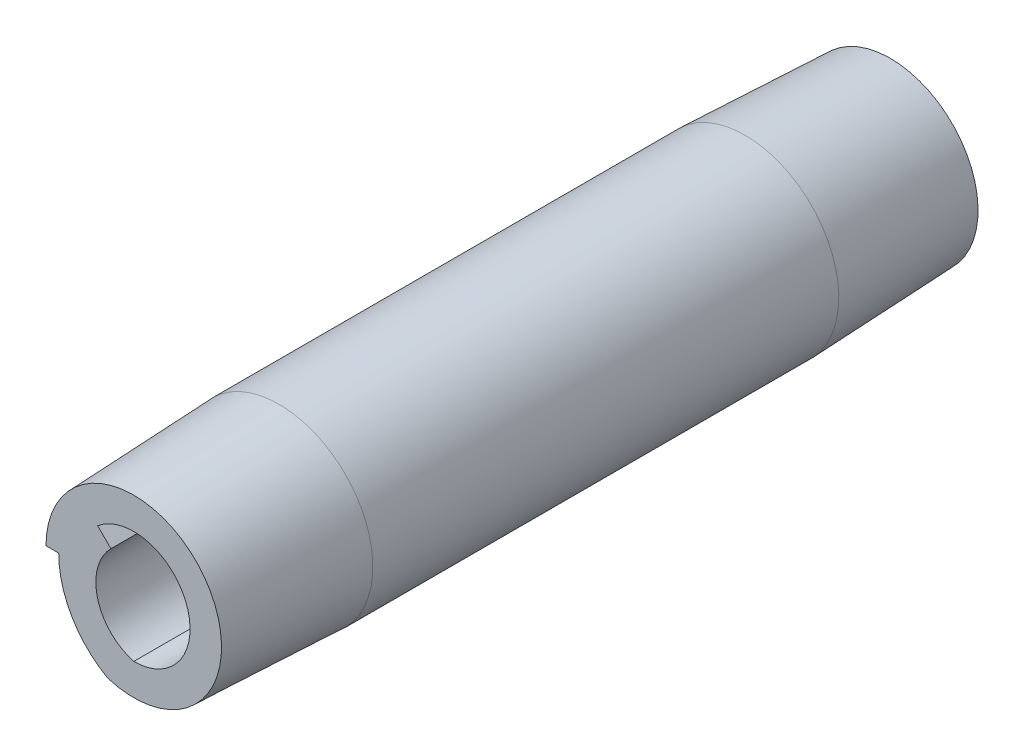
ISO-10303-21;
HEADER;
FILE_DESCRIPTION(('STEP AP214'),'2;1');
FILE_NAME('part.step','',(''),(''),'','','');
FILE_SCHEMA(('AUTOMOTIVE_DESIGN { 1 0 10303 214 1 1 1 1 }'));
ENDSEC;
DATA;
#1=APPLICATION_CONTEXT('core data for automotive mechanical design processes');
#2=APPLICATION_PROTOCOL_DEFINITION('international standard','automotive_design',2000,#1);
#3=PRODUCT_CONTEXT('',#1,'mechanical');
#4=PRODUCT('Part','Part','',(#3));
#5=PRODUCT_RELATED_PRODUCT_CATEGORY('part','',(#4));
#6=PRODUCT_DEFINITION_FORMATION('','',#4);
#7=PRODUCT_DEFINITION_CONTEXT('part definition',#1,'design');
#8=PRODUCT_DEFINITION('design','',#6,#7);
#9=PRODUCT_DEFINITION_SHAPE('','',#8);
#10=(LENGTH_UNIT() NAMED_UNIT(*) SI_UNIT(.MILLI.,.METRE.));
#11=(NAMED_UNIT(*) PLANE_ANGLE_UNIT() SI_UNIT($,.RADIAN.));
#12=(NAMED_UNIT(*) SI_UNIT($,.STERADIAN.) SOLID_ANGLE_UNIT());
#13=UNCERTAINTY_MEASURE_WITH_UNIT(LENGTH_MEASURE(1.E-05),#10,'distance_accuracy_value','');
#14=(GEOMETRIC_REPRESENTATION_CONTEXT(3) GLOBAL_UNCERTAINTY_ASSIGNED_CONTEXT((#13)) GLOBAL_UNIT_ASSIGNED_CONTEXT((#10,
#11,#12)) REPRESENTATION_CONTEXT('',''));
#15=CARTESIAN_POINT('',(0.,0.,0.));
#16=DIRECTION('',(0.,0.,1.));
#17=DIRECTION('',(1.,0.,0.));
#18=AXIS2_PLACEMENT_3D('',#15,#16,#17);
#19=CARTESIAN_POINT('',(0.,0.,1.5875));
#20=DIRECTION('',(0.,0.,-1.));
#21=DIRECTION('',(-1.,0.,0.));
#22=AXIS2_PLACEMENT_3D('',#19,#20,#21);
#23=PLANE('',#22);
#24=CARTESIAN_POINT('',(0.,0.,1.5875));
#25=DIRECTION('',(0.,0.,1.));
#26=DIRECTION('',(-1.,0.,0.));
#27=AXIS2_PLACEMENT_3D('',#24,#25,#26);
#28=CIRCLE('',#27,0.23622);
#29=CARTESIAN_POINT('',(0.,-0.23622,1.5875));
#30=VERTEX_POINT('',#29);
#31=CARTESIAN_POINT('',(-0.151522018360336,0.181220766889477,1.5875));
#32=VERTEX_POINT('',#31);
#33=EDGE_CURVE('E188',#30,#32,#28,.T.);
#34=ORIENTED_EDGE('',*,*,#33,.F.);
#35=CARTESIAN_POINT('',(0.0571892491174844,-0.0274905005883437,1.5875));
#36=DIRECTION('',(0.,0.,1.));
#37=DIRECTION('',(-1.,0.,0.));
#38=AXIS2_PLACEMENT_3D('',#35,#36,#37);
#39=CIRCLE('',#38,0.216422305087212);
#40=CARTESIAN_POINT('',(-0.0958444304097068,0.125543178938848,1.5875));
#41=VERTEX_POINT('',#40);
#42=EDGE_CURVE('E197',#41,#30,#39,.T.);
#43=ORIENTED_EDGE('',*,*,#42,.F.);
#44=DIRECTION('',(0.707106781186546,-0.707106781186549,0.));
#45=VECTOR('',#44,1.);
#46=CARTESIAN_POINT('',(-0.151522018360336,0.181220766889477,1.5875));
#47=LINE('',#46,#45);
#48=EDGE_CURVE('E190',#32,#41,#47,.T.);
#49=ORIENTED_EDGE('',*,*,#48,.F.);
#50=EDGE_LOOP('',(#34,#43,#49));
#51=FACE_BOUND('',#50,.T.);
#52=CARTESIAN_POINT('',(0.0885825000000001,0.,1.5875));
#53=DIRECTION('',(0.,0.,1.));
#54=DIRECTION('',(-1.,0.,0.));
#55=AXIS2_PLACEMENT_3D('',#52,#53,#54);
#56=CIRCLE('',#55,0.4035425);
#57=CARTESIAN_POINT('',(-0.31496,0.,1.5875));
#58=VERTEX_POINT('',#57);
#59=CARTESIAN_POINT('',(-0.109247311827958,-0.351724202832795,1.5875));
#60=VERTEX_POINT('',#59);
#61=EDGE_CURVE('E138',#58,#60,#56,.T.);
#62=ORIENTED_EDGE('',*,*,#61,.T.);
#63=CARTESIAN_POINT('',(0.,0.,1.5875));
#64=DIRECTION('',(0.,0.,-1.));
#65=DIRECTION('',(-1.,0.,0.));
#66=AXIS2_PLACEMENT_3D('',#63,#64,#65);
#67=CIRCLE('',#66,0.3683);
#68=CARTESIAN_POINT('',(-0.3683,0.,1.5875));
#69=VERTEX_POINT('',#68);
#70=EDGE_CURVE('E60',#69,#60,#67,.T.);
#71=ORIENTED_EDGE('',*,*,#70,.F.);
#72=DIRECTION('',(1.,0.,0.));
#73=VECTOR('',#72,1.);
#74=CARTESIAN_POINT('',(-0.3937,0.,1.5875));
#75=LINE('',#74,#73);
#76=EDGE_CURVE('E132',#69,#58,#75,.T.);
#77=ORIENTED_EDGE('',*,*,#76,.T.);
#78=EDGE_LOOP('',(#62,#71,#77));
#79=FACE_BOUND('',#78,.T.);
#80=ADVANCED_FACE('F39',(#51,#79),#23,.F.);
#81=CARTESIAN_POINT('',(0.,0.,-1.5875));
#82=DIRECTION('',(0.,0.,-1.));
#83=DIRECTION('',(-1.,0.,0.));
#84=AXIS2_PLACEMENT_3D('',#81,#82,#83);
#85=PLANE('',#84);
#86=CARTESIAN_POINT('',(0.0571892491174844,-0.0274905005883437,-1.5875));
#87=DIRECTION('',(0.,0.,1.));
#88=DIRECTION('',(-1.,0.,0.));
#89=AXIS2_PLACEMENT_3D('',#86,#87,#88);
#90=CIRCLE('',#89,0.216422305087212);
#91=CARTESIAN_POINT('',(-0.0958444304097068,0.125543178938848,-1.5875));
#92=VERTEX_POINT('',#91);
#93=CARTESIAN_POINT('',(0.,-0.23622,-1.5875));
#94=VERTEX_POINT('',#93);
#95=EDGE_CURVE('E184',#92,#94,#90,.T.);
#96=ORIENTED_EDGE('',*,*,#95,.T.);
#97=CARTESIAN_POINT('',(0.,0.,-1.5875));
#98=DIRECTION('',(0.,0.,1.));
#99=DIRECTION('',(-1.,0.,0.));
#100=AXIS2_PLACEMENT_3D('',#97,#98,#99);
#101=CIRCLE('',#100,0.23622);
#102=CARTESIAN_POINT('',(-0.151522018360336,0.181220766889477,-1.5875));
#103=VERTEX_POINT('',#102);
#104=EDGE_CURVE('E185',#94,#103,#101,.T.);
#105=ORIENTED_EDGE('',*,*,#104,.T.);
#106=DIRECTION('',(0.707106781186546,-0.707106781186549,0.));
#107=VECTOR('',#106,1.);
#108=CARTESIAN_POINT('',(-0.151522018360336,0.181220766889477,-1.5875));
#109=LINE('',#108,#107);
#110=EDGE_CURVE('E186',#103,#92,#109,.T.);
#111=ORIENTED_EDGE('',*,*,#110,.T.);
#112=EDGE_LOOP('',(#96,#105,#111));
#113=FACE_BOUND('',#112,.T.);
#114=CARTESIAN_POINT('',(0.,0.,-1.5875));
#115=DIRECTION('',(0.,0.,-1.));
#116=DIRECTION('',(-1.,0.,0.));
#117=AXIS2_PLACEMENT_3D('',#114,#115,#116);
#118=CIRCLE('',#117,0.3683);
#119=CARTESIAN_POINT('',(-0.3683,0.,-1.5875));
#120=VERTEX_POINT('',#119);
#121=CARTESIAN_POINT('',(-0.109247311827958,-0.351724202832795,-1.5875));
#122=VERTEX_POINT('',#121);
#123=EDGE_CURVE('E107',#120,#122,#118,.T.);
#124=ORIENTED_EDGE('',*,*,#123,.T.);
#125=CARTESIAN_POINT('',(0.0885825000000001,0.,-1.5875));
#126=DIRECTION('',(0.,0.,1.));
#127=DIRECTION('',(-1.,0.,0.));
#128=AXIS2_PLACEMENT_3D('',#125,#126,#127);
#129=CIRCLE('',#128,0.4035425);
#130=CARTESIAN_POINT('',(-0.31496,0.,-1.5875));
#131=VERTEX_POINT('',#130);
#132=EDGE_CURVE('E129',#131,#122,#129,.T.);
#133=ORIENTED_EDGE('',*,*,#132,.F.);
#134=DIRECTION('',(1.,0.,0.));
#135=VECTOR('',#134,1.);
#136=CARTESIAN_POINT('',(-0.3937,0.,-1.5875));
#137=LINE('',#136,#135);
#138=EDGE_CURVE('E121',#120,#131,#137,.T.);
#139=ORIENTED_EDGE('',*,*,#138,.F.);
#140=EDGE_LOOP('',(#124,#133,#139));
#141=FACE_BOUND('',#140,.T.);
#142=ADVANCED_FACE('F128',(#113,#141),#85,.T.);
#143=CARTESIAN_POINT('',(0.,0.,1.5875));
#144=DIRECTION('',(0.,0.,-1.));
#145=DIRECTION('',(-1.,0.,0.));
#146=AXIS2_PLACEMENT_3D('',#143,#144,#145);
#147=CYLINDRICAL_SURFACE('',#146,0.3937);
#148=DIRECTION('',(0.,0.,-1.));
#149=VECTOR('',#148,1.);
#150=CARTESIAN_POINT('',(-0.3937,0.,1.5875));
#151=LINE('',#150,#149);
#152=CARTESIAN_POINT('',(-0.3937,0.,0.9779));
#153=VERTEX_POINT('',#152);
#154=CARTESIAN_POINT('',(-0.3937,0.,-0.9779));
#155=VERTEX_POINT('',#154);
#156=EDGE_CURVE('E125',#153,#155,#151,.T.);
#157=ORIENTED_EDGE('',*,*,#156,.F.);
#158=CARTESIAN_POINT('',(0.,0.,0.9779));
#159=DIRECTION('',(0.,0.,-1.));
#160=DIRECTION('',(-1.,0.,0.));
#161=AXIS2_PLACEMENT_3D('',#158,#159,#160);
#162=CIRCLE('',#161,0.3937);
#163=CARTESIAN_POINT('',(0.,-0.3937,0.9779));
#164=VERTEX_POINT('',#163);
#165=EDGE_CURVE('E204',#153,#164,#162,.T.);
#166=ORIENTED_EDGE('',*,*,#165,.T.);
#167=DIRECTION('',(0.,0.,-1.));
#168=VECTOR('',#167,1.);
#169=CARTESIAN_POINT('',(0.,-0.3937,1.5875));
#170=LINE('',#169,#168);
#171=CARTESIAN_POINT('',(0.,-0.3937,-0.977899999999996));
#172=VERTEX_POINT('',#171);
#173=EDGE_CURVE('E141',#164,#172,#170,.T.);
#174=ORIENTED_EDGE('',*,*,#173,.T.);
#175=CARTESIAN_POINT('',(0.,0.,-0.9779));
#176=DIRECTION('',(0.,0.,-1.));
#177=DIRECTION('',(-1.,0.,0.));
#178=AXIS2_PLACEMENT_3D('',#175,#176,#177);
#179=CIRCLE('',#178,0.3937);
#180=EDGE_CURVE('E67',#155,#172,#179,.T.);
#181=ORIENTED_EDGE('',*,*,#180,.F.);
#182=EDGE_LOOP('',(#157,#166,#174,#181));
#183=FACE_BOUND('',#182,.T.);
#184=ADVANCED_FACE('F41',(#183),#147,.T.);
#185=CARTESIAN_POINT('',(-0.3937,0.,1.5875));
#186=DIRECTION('',(0.,1.,0.));
#187=DIRECTION('',(0.,0.,1.));
#188=AXIS2_PLACEMENT_3D('',#185,#186,#187);
#189=PLANE('',#188);
#190=ORIENTED_EDGE('',*,*,#76,.F.);
#191=DIRECTION('',(0.0416305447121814,0.,0.999133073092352));
#192=VECTOR('',#191,1.);
#193=CARTESIAN_POINT('',(0.,0.,10.4267));
#194=LINE('',#193,#192);
#195=EDGE_CURVE('E126',#69,#153,#194,.F.);
#196=ORIENTED_EDGE('',*,*,#195,.T.);
#197=ORIENTED_EDGE('',*,*,#156,.T.);
#198=DIRECTION('',(-0.0416305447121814,0.,0.999133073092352));
#199=VECTOR('',#198,1.);
#200=CARTESIAN_POINT('',(0.,0.,-10.4267));
#201=LINE('',#200,#199);
#202=EDGE_CURVE('E110',#155,#120,#201,.F.);
#203=ORIENTED_EDGE('',*,*,#202,.T.);
#204=ORIENTED_EDGE('',*,*,#138,.T.);
#205=DIRECTION('',(0.,0.,-1.));
#206=VECTOR('',#205,1.);
#207=CARTESIAN_POINT('',(-0.31496,0.,1.5875));
#208=LINE('',#207,#206);
#209=EDGE_CURVE('E144',#58,#131,#208,.T.);
#210=ORIENTED_EDGE('',*,*,#209,.F.);
#211=EDGE_LOOP('',(#190,#196,#197,#203,#204,#210));
#212=FACE_BOUND('',#211,.T.);
#213=ADVANCED_FACE('F119',(#212),#189,.F.);
#214=CARTESIAN_POINT('',(0.0885825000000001,0.,1.5875));
#215=DIRECTION('',(0.,0.,-1.));
#216=DIRECTION('',(-1.,0.,0.));
#217=AXIS2_PLACEMENT_3D('',#214,#215,#216);
#218=CYLINDRICAL_SURFACE('',#217,0.4035425);
#219=ORIENTED_EDGE('',*,*,#173,.F.);
#220=CARTESIAN_POINT('',(3.70374290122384E-05,-0.393708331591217,0.9777));
#221=CARTESIAN_POINT('',(-0.00938256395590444,-0.391587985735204,1.02856466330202));
#222=CARTESIAN_POINT('',(-0.0187261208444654,-0.389133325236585,1.07942962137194));
#223=CARTESIAN_POINT('',(-0.0372576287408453,-0.383542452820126,1.1811401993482));
#224=CARTESIAN_POINT('',(-0.0464456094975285,-0.380406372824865,1.23198582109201));
#225=CARTESIAN_POINT('',(-0.0646662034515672,-0.373438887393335,1.33365809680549));
#226=CARTESIAN_POINT('',(-0.073698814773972,-0.369607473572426,1.38448475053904));
#227=CARTESIAN_POINT('',(-0.091608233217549,-0.361213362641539,1.4861152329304));
#228=CARTESIAN_POINT('',(-0.100485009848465,-0.356650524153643,1.53691905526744));
#229=CARTESIAN_POINT('',(-0.109281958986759,-0.351704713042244,1.5877));
#230=B_SPLINE_CURVE_WITH_KNOTS('',3,(#220,#221,#222,#223,#224,#225,#226,#227,#228,#229),
.UNSPECIFIED.,.F.,.F.,(4,2,2,2,4),(0.,0.155317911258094,0.310605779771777,0.465895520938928,
0.62121531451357),.UNSPECIFIED.);
#231=EDGE_CURVE('E11',#164,#60,#230,.T.);
#232=ORIENTED_EDGE('',*,*,#231,.T.);
#233=ORIENTED_EDGE('',*,*,#61,.F.);
#234=ORIENTED_EDGE('',*,*,#209,.T.);
#235=ORIENTED_EDGE('',*,*,#132,.T.);
#236=CARTESIAN_POINT('',(-0.109281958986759,-0.351704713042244,-1.5877));
#237=CARTESIAN_POINT('',(-0.100485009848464,-0.356650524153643,-1.53691905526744));
#238=CARTESIAN_POINT('',(-0.0916082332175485,-0.361213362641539,-1.4861152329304));
#239=CARTESIAN_POINT('',(-0.0736988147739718,-0.369607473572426,-1.38448475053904));
#240=CARTESIAN_POINT('',(-0.0646662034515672,-0.373438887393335,-1.33365809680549));
#241=CARTESIAN_POINT('',(-0.0464456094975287,-0.380406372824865,-1.23198582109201));
#242=CARTESIAN_POINT('',(-0.0372576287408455,-0.383542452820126,-1.1811401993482));
#243=CARTESIAN_POINT('',(-0.0187261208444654,-0.389133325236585,-1.07942962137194));
#244=CARTESIAN_POINT('',(-0.00938256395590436,-0.391587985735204,-1.02856466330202));
#245=CARTESIAN_POINT('',(3.70374290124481E-05,-0.393708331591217,-0.9777));
#246=B_SPLINE_CURVE_WITH_KNOTS('',3,(#236,#237,#238,#239,#240,#241,#242,#243,#244,#245),
.UNSPECIFIED.,.F.,.F.,(4,2,2,2,4),(0.,0.155319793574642,0.310609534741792,0.465897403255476,
0.62121531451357),.UNSPECIFIED.);
#247=EDGE_CURVE('E53',#122,#172,#246,.T.);
#248=ORIENTED_EDGE('',*,*,#247,.T.);
#249=EDGE_LOOP('',(#219,#232,#233,#234,#235,#248));
#250=FACE_BOUND('',#249,.T.);
#251=ADVANCED_FACE('F151',(#250),#218,.T.);
#252=CARTESIAN_POINT('',(0.,0.,1.5875));
#253=DIRECTION('',(0.,0.,-1.));
#254=DIRECTION('',(-1.,0.,0.));
#255=AXIS2_PLACEMENT_3D('',#252,#253,#254);
#256=CYLINDRICAL_SURFACE('',#255,0.23622);
#257=ORIENTED_EDGE('',*,*,#104,.F.);
#258=DIRECTION('',(0.,0.,-1.));
#259=VECTOR('',#258,1.);
#260=CARTESIAN_POINT('',(0.,-0.23622,1.5875));
#261=LINE('',#260,#259);
#262=EDGE_CURVE('E195',#30,#94,#261,.T.);
#263=ORIENTED_EDGE('',*,*,#262,.F.);
#264=ORIENTED_EDGE('',*,*,#33,.T.);
#265=DIRECTION('',(0.,0.,-1.));
#266=VECTOR('',#265,1.);
#267=CARTESIAN_POINT('',(-0.151522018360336,0.181220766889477,1.5875));
#268=LINE('',#267,#266);
#269=EDGE_CURVE('E130',#32,#103,#268,.T.);
#270=ORIENTED_EDGE('',*,*,#269,.T.);
#271=EDGE_LOOP('',(#257,#263,#264,#270));
#272=FACE_BOUND('',#271,.T.);
#273=ADVANCED_FACE('F167',(#272),#256,.F.);
#274=CARTESIAN_POINT('',(-0.151522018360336,0.181220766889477,1.5875));
#275=DIRECTION('',(0.707106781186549,0.707106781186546,0.));
#276=DIRECTION('',(-0.707106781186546,0.707106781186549,0.));
#277=AXIS2_PLACEMENT_3D('',#274,#275,#276);
#278=PLANE('',#277);
#279=ORIENTED_EDGE('',*,*,#110,.F.);
#280=ORIENTED_EDGE('',*,*,#269,.F.);
#281=ORIENTED_EDGE('',*,*,#48,.T.);
#282=DIRECTION('',(0.,0.,-1.));
#283=VECTOR('',#282,1.);
#284=CARTESIAN_POINT('',(-0.0958444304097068,0.125543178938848,1.5875));
#285=LINE('',#284,#283);
#286=EDGE_CURVE('E135',#41,#92,#285,.T.);
#287=ORIENTED_EDGE('',*,*,#286,.T.);
#288=EDGE_LOOP('',(#279,#280,#281,#287));
#289=FACE_BOUND('',#288,.T.);
#290=ADVANCED_FACE('F163',(#289),#278,.T.);
#291=CARTESIAN_POINT('',(0.0571892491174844,-0.0274905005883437,1.5875));
#292=DIRECTION('',(0.,0.,-1.));
#293=DIRECTION('',(-1.,0.,0.));
#294=AXIS2_PLACEMENT_3D('',#291,#292,#293);
#295=CYLINDRICAL_SURFACE('',#294,0.216422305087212);
#296=ORIENTED_EDGE('',*,*,#95,.F.);
#297=ORIENTED_EDGE('',*,*,#286,.F.);
#298=ORIENTED_EDGE('',*,*,#42,.T.);
#299=ORIENTED_EDGE('',*,*,#262,.T.);
#300=EDGE_LOOP('',(#296,#297,#298,#299));
#301=FACE_BOUND('',#300,.T.);
#302=ADVANCED_FACE('F157',(#301),#295,.F.);
#303=CARTESIAN_POINT('',(0.,0.,-0.9779));
#304=DIRECTION('',(0.,0.,1.));
#305=DIRECTION('',(1.,0.,0.));
#306=AXIS2_PLACEMENT_3D('',#303,#304,#305);
#307=CONICAL_SURFACE('',#306,0.3937,0.0416425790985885);
#308=ORIENTED_EDGE('',*,*,#180,.T.);
#309=ORIENTED_EDGE('',*,*,#247,.F.);
#310=ORIENTED_EDGE('',*,*,#123,.F.);
#311=ORIENTED_EDGE('',*,*,#202,.F.);
#312=EDGE_LOOP('',(#308,#309,#310,#311));
#313=FACE_BOUND('',#312,.T.);
#314=ADVANCED_FACE('F109',(#313),#307,.T.);
#315=CARTESIAN_POINT('',(0.,0.,1.5875));
#316=DIRECTION('',(0.,0.,-1.));
#317=DIRECTION('',(-1.,0.,0.));
#318=AXIS2_PLACEMENT_3D('',#315,#316,#317);
#319=CONICAL_SURFACE('',#318,0.3683,0.0416425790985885);
#320=ORIENTED_EDGE('',*,*,#70,.T.);
#321=ORIENTED_EDGE('',*,*,#231,.F.);
#322=ORIENTED_EDGE('',*,*,#165,.F.);
#323=ORIENTED_EDGE('',*,*,#195,.F.);
#324=EDGE_LOOP('',(#320,#321,#322,#323));
#325=FACE_BOUND('',#324,.T.);
#326=ADVANCED_FACE('F156',(#325),#319,.T.);
#327=CLOSED_SHELL('',(#80,#142,#184,#213,#251,#273,#290,#302,#314,#326));
#328=MANIFOLD_SOLID_BREP('B2',#327);
#329=ADVANCED_BREP_SHAPE_REPRESENTATION('',(#18,#328),#14);
#330=SHAPE_DEFINITION_REPRESENTATION(#9,#329);
ENDSEC;
END-ISO-10303-21;
